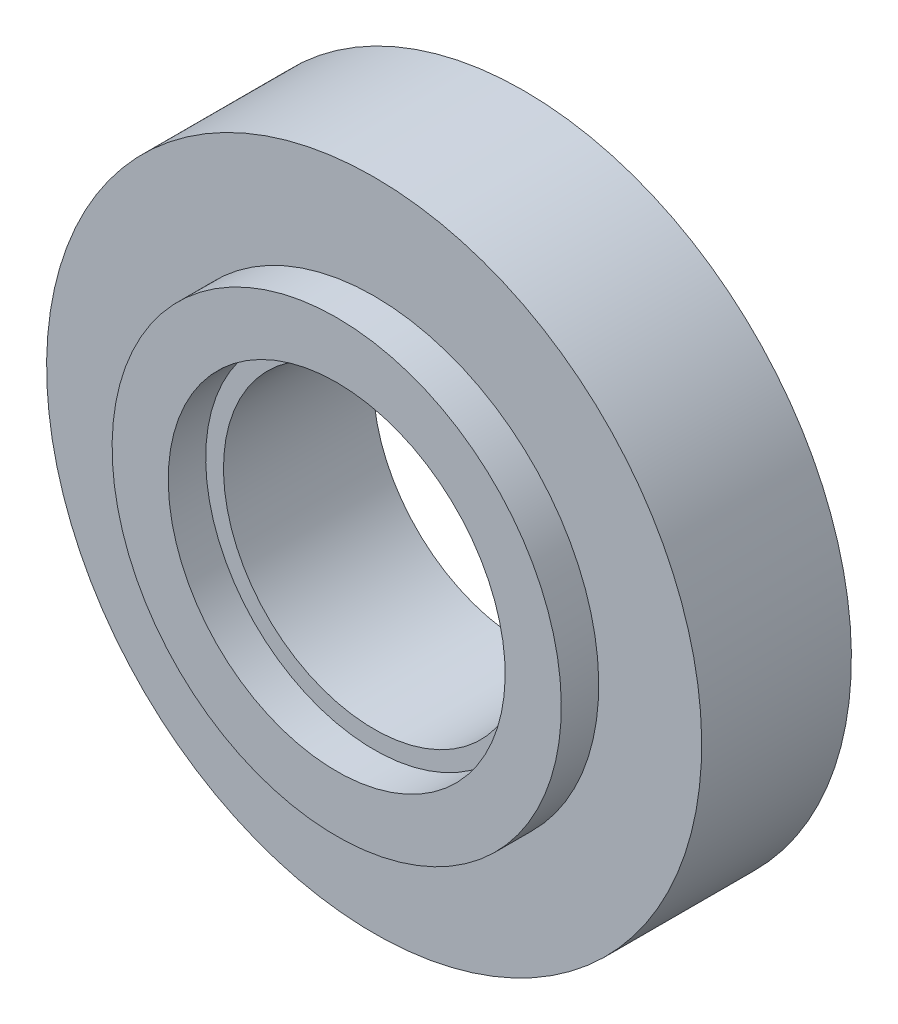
ISO-10303-21;
HEADER;
FILE_DESCRIPTION(('STEP AP214'),'2;1');
FILE_NAME('part.step','',(''),(''),'','','');
FILE_SCHEMA(('AUTOMOTIVE_DESIGN { 1 0 10303 214 1 1 1 1 }'));
ENDSEC;
DATA;
#1=APPLICATION_CONTEXT('core data for automotive mechanical design processes');
#2=APPLICATION_PROTOCOL_DEFINITION('international standard','automotive_design',2000,#1);
#3=PRODUCT_CONTEXT('',#1,'mechanical');
#4=PRODUCT('Part','Part','',(#3));
#5=PRODUCT_RELATED_PRODUCT_CATEGORY('part','',(#4));
#6=PRODUCT_DEFINITION_FORMATION('','',#4);
#7=PRODUCT_DEFINITION_CONTEXT('part definition',#1,'design');
#8=PRODUCT_DEFINITION('design','',#6,#7);
#9=PRODUCT_DEFINITION_SHAPE('','',#8);
#10=(LENGTH_UNIT() NAMED_UNIT(*) SI_UNIT(.MILLI.,.METRE.));
#11=(NAMED_UNIT(*) PLANE_ANGLE_UNIT() SI_UNIT($,.RADIAN.));
#12=(NAMED_UNIT(*) SI_UNIT($,.STERADIAN.) SOLID_ANGLE_UNIT());
#13=UNCERTAINTY_MEASURE_WITH_UNIT(LENGTH_MEASURE(1.E-05),#10,'distance_accuracy_value','');
#14=(GEOMETRIC_REPRESENTATION_CONTEXT(3) GLOBAL_UNCERTAINTY_ASSIGNED_CONTEXT((#13)) GLOBAL_UNIT_ASSIGNED_CONTEXT((#10,
#11,#12)) REPRESENTATION_CONTEXT('',''));
#15=CARTESIAN_POINT('',(0.,0.,0.));
#16=DIRECTION('',(0.,0.,1.));
#17=DIRECTION('',(1.,0.,0.));
#18=AXIS2_PLACEMENT_3D('',#15,#16,#17);
#19=CARTESIAN_POINT('',(0.,0.,16.));
#20=DIRECTION('',(0.,0.,-1.));
#21=DIRECTION('',(0.,1.,0.));
#22=AXIS2_PLACEMENT_3D('',#19,#20,#21);
#23=PLANE('',#22);
#24=CARTESIAN_POINT('',(0.,0.,16.));
#25=DIRECTION('',(0.,0.,-1.));
#26=DIRECTION('',(0.,1.,0.));
#27=AXIS2_PLACEMENT_3D('',#24,#25,#26);
#28=CIRCLE('',#27,12.);
#29=CARTESIAN_POINT('',(0.,12.,16.));
#30=VERTEX_POINT('',#29);
#31=EDGE_CURVE('E37',#30,#30,#28,.T.);
#32=ORIENTED_EDGE('',*,*,#31,.F.);
#33=EDGE_LOOP('',(#32));
#34=FACE_BOUND('',#33,.T.);
#35=CARTESIAN_POINT('',(0.,0.,16.));
#36=DIRECTION('',(0.,0.,-1.));
#37=DIRECTION('',(0.,1.,0.));
#38=AXIS2_PLACEMENT_3D('',#35,#36,#37);
#39=CIRCLE('',#38,8.99999999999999);
#40=CARTESIAN_POINT('',(0.,9.00000000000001,16.));
#41=VERTEX_POINT('',#40);
#42=EDGE_CURVE('E44',#41,#41,#39,.T.);
#43=ORIENTED_EDGE('',*,*,#42,.T.);
#44=EDGE_LOOP('',(#43));
#45=FACE_BOUND('',#44,.T.);
#46=ADVANCED_FACE('F33',(#34,#45),#23,.F.);
#47=CARTESIAN_POINT('',(0.,0.,14.));
#48=DIRECTION('',(0.,0.,1.));
#49=DIRECTION('',(0.,-1.,0.));
#50=AXIS2_PLACEMENT_3D('',#47,#48,#49);
#51=CYLINDRICAL_SURFACE('',#50,12.);
#52=CARTESIAN_POINT('',(0.,0.,14.));
#53=DIRECTION('',(0.,0.,-1.));
#54=DIRECTION('',(0.,1.,0.));
#55=AXIS2_PLACEMENT_3D('',#52,#53,#54);
#56=CIRCLE('',#55,12.);
#57=CARTESIAN_POINT('',(0.,12.,14.));
#58=VERTEX_POINT('',#57);
#59=EDGE_CURVE('E10',#58,#58,#56,.T.);
#60=ORIENTED_EDGE('',*,*,#59,.F.);
#61=EDGE_LOOP('',(#60));
#62=FACE_BOUND('',#61,.T.);
#63=ORIENTED_EDGE('',*,*,#31,.T.);
#64=EDGE_LOOP('',(#63));
#65=FACE_BOUND('',#64,.T.);
#66=ADVANCED_FACE('F35',(#62,#65),#51,.T.);
#67=CARTESIAN_POINT('',(0.,0.,14.));
#68=DIRECTION('',(0.,0.,1.));
#69=DIRECTION('',(0.,-1.,0.));
#70=AXIS2_PLACEMENT_3D('',#67,#68,#69);
#71=CYLINDRICAL_SURFACE('',#70,8.99999999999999);
#72=CARTESIAN_POINT('',(0.,0.,14.));
#73=DIRECTION('',(0.,0.,-1.));
#74=DIRECTION('',(0.,1.,0.));
#75=AXIS2_PLACEMENT_3D('',#72,#73,#74);
#76=CIRCLE('',#75,8.99999999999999);
#77=CARTESIAN_POINT('',(0.,9.00000000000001,14.));
#78=VERTEX_POINT('',#77);
#79=EDGE_CURVE('E48',#78,#78,#76,.T.);
#80=ORIENTED_EDGE('',*,*,#79,.T.);
#81=EDGE_LOOP('',(#80));
#82=FACE_BOUND('',#81,.T.);
#83=ORIENTED_EDGE('',*,*,#42,.F.);
#84=EDGE_LOOP('',(#83));
#85=FACE_BOUND('',#84,.T.);
#86=ADVANCED_FACE('F107',(#82,#85),#71,.F.);
#87=CARTESIAN_POINT('',(0.,0.,14.));
#88=DIRECTION('',(0.,0.,-1.));
#89=DIRECTION('',(0.,1.,0.));
#90=AXIS2_PLACEMENT_3D('',#87,#88,#89);
#91=PLANE('',#90);
#92=CARTESIAN_POINT('',(0.,0.,14.));
#93=DIRECTION('',(0.,0.,-1.));
#94=DIRECTION('',(0.,1.,0.));
#95=AXIS2_PLACEMENT_3D('',#92,#93,#94);
#96=CIRCLE('',#95,8.05);
#97=CARTESIAN_POINT('',(0.,8.05000000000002,14.));
#98=VERTEX_POINT('',#97);
#99=EDGE_CURVE('E58',#98,#98,#96,.T.);
#100=ORIENTED_EDGE('',*,*,#99,.T.);
#101=EDGE_LOOP('',(#100));
#102=FACE_BOUND('',#101,.T.);
#103=ORIENTED_EDGE('',*,*,#79,.F.);
#104=EDGE_LOOP('',(#103));
#105=FACE_BOUND('',#104,.T.);
#106=ADVANCED_FACE('F89',(#102,#105),#91,.F.);
#107=CARTESIAN_POINT('',(0.,0.,6.00000000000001));
#108=DIRECTION('',(0.,0.,-1.));
#109=DIRECTION('',(0.,1.,0.));
#110=AXIS2_PLACEMENT_3D('',#107,#108,#109);
#111=PLANE('',#110);
#112=CARTESIAN_POINT('',(0.,-13.,6.));
#113=DIRECTION('',(0.,0.,-1.));
#114=DIRECTION('',(0.,1.,0.));
#115=AXIS2_PLACEMENT_3D('',#112,#113,#114);
#116=CIRCLE('',#115,1.6);
#117=CARTESIAN_POINT('',(0.,-11.4,6.));
#118=VERTEX_POINT('',#117);
#119=EDGE_CURVE('E70',#118,#118,#116,.T.);
#120=ORIENTED_EDGE('',*,*,#119,.F.);
#121=EDGE_LOOP('',(#120));
#122=FACE_BOUND('',#121,.T.);
#123=CARTESIAN_POINT('',(0.,13.,6.00000000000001));
#124=DIRECTION('',(0.,0.,-1.));
#125=DIRECTION('',(0.,1.,0.));
#126=AXIS2_PLACEMENT_3D('',#123,#124,#125);
#127=CIRCLE('',#126,1.6);
#128=CARTESIAN_POINT('',(0.,14.6,6.00000000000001));
#129=VERTEX_POINT('',#128);
#130=EDGE_CURVE('E64',#129,#129,#127,.T.);
#131=ORIENTED_EDGE('',*,*,#130,.F.);
#132=EDGE_LOOP('',(#131));
#133=FACE_BOUND('',#132,.T.);
#134=CARTESIAN_POINT('',(0.,0.,6.00000000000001));
#135=DIRECTION('',(0.,0.,-1.));
#136=DIRECTION('',(0.,1.,0.));
#137=AXIS2_PLACEMENT_3D('',#134,#135,#136);
#138=CIRCLE('',#137,17.5);
#139=CARTESIAN_POINT('',(0.,17.5,6.00000000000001));
#140=VERTEX_POINT('',#139);
#141=EDGE_CURVE('E51',#140,#140,#138,.T.);
#142=ORIENTED_EDGE('',*,*,#141,.T.);
#143=EDGE_LOOP('',(#142));
#144=FACE_BOUND('',#143,.T.);
#145=CARTESIAN_POINT('',(0.,0.,6.00000000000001));
#146=DIRECTION('',(0.,0.,-1.));
#147=DIRECTION('',(0.,1.,0.));
#148=AXIS2_PLACEMENT_3D('',#145,#146,#147);
#149=CIRCLE('',#148,8.05);
#150=CARTESIAN_POINT('',(0.,8.05000000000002,6.00000000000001));
#151=VERTEX_POINT('',#150);
#152=EDGE_CURVE('E55',#151,#151,#149,.T.);
#153=ORIENTED_EDGE('',*,*,#152,.F.);
#154=EDGE_LOOP('',(#153));
#155=FACE_BOUND('',#154,.T.);
#156=ADVANCED_FACE('F85',(#122,#133,#144,#155),#111,.T.);
#157=ORIENTED_EDGE('',*,*,#59,.T.);
#158=EDGE_LOOP('',(#157));
#159=FACE_BOUND('',#158,.T.);
#160=CARTESIAN_POINT('',(0.,0.,14.));
#161=DIRECTION('',(0.,0.,-1.));
#162=DIRECTION('',(0.,1.,0.));
#163=AXIS2_PLACEMENT_3D('',#160,#161,#162);
#164=CIRCLE('',#163,17.5);
#165=CARTESIAN_POINT('',(0.,17.5,14.));
#166=VERTEX_POINT('',#165);
#167=EDGE_CURVE('E52',#166,#166,#164,.T.);
#168=ORIENTED_EDGE('',*,*,#167,.F.);
#169=EDGE_LOOP('',(#168));
#170=FACE_BOUND('',#169,.T.);
#171=ADVANCED_FACE('F88',(#159,#170),#91,.F.);
#172=CARTESIAN_POINT('',(0.,0.,6.00000000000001));
#173=DIRECTION('',(0.,0.,1.));
#174=DIRECTION('',(0.,-1.,0.));
#175=AXIS2_PLACEMENT_3D('',#172,#173,#174);
#176=CYLINDRICAL_SURFACE('',#175,17.5);
#177=ORIENTED_EDGE('',*,*,#141,.F.);
#178=EDGE_LOOP('',(#177));
#179=FACE_BOUND('',#178,.T.);
#180=ORIENTED_EDGE('',*,*,#167,.T.);
#181=EDGE_LOOP('',(#180));
#182=FACE_BOUND('',#181,.T.);
#183=ADVANCED_FACE('F101',(#179,#182),#176,.T.);
#184=CARTESIAN_POINT('',(0.,0.,6.00000000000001));
#185=DIRECTION('',(0.,0.,1.));
#186=DIRECTION('',(0.,-1.,0.));
#187=AXIS2_PLACEMENT_3D('',#184,#185,#186);
#188=CYLINDRICAL_SURFACE('',#187,8.05);
#189=ORIENTED_EDGE('',*,*,#152,.T.);
#190=EDGE_LOOP('',(#189));
#191=FACE_BOUND('',#190,.T.);
#192=ORIENTED_EDGE('',*,*,#99,.F.);
#193=EDGE_LOOP('',(#192));
#194=FACE_BOUND('',#193,.T.);
#195=ADVANCED_FACE('F97',(#191,#194),#188,.F.);
#196=CARTESIAN_POINT('',(0.,13.,11.));
#197=DIRECTION('',(0.,0.,-1.));
#198=DIRECTION('',(0.,1.,0.));
#199=AXIS2_PLACEMENT_3D('',#196,#197,#198);
#200=CYLINDRICAL_SURFACE('',#199,1.6);
#201=CARTESIAN_POINT('',(0.,13.,11.));
#202=DIRECTION('',(0.,0.,-1.));
#203=DIRECTION('',(0.,1.,0.));
#204=AXIS2_PLACEMENT_3D('',#201,#202,#203);
#205=CIRCLE('',#204,1.6);
#206=CARTESIAN_POINT('',(0.,14.6,11.));
#207=VERTEX_POINT('',#206);
#208=EDGE_CURVE('E67',#207,#207,#205,.T.);
#209=ORIENTED_EDGE('',*,*,#208,.F.);
#210=EDGE_LOOP('',(#209));
#211=FACE_BOUND('',#210,.T.);
#212=ORIENTED_EDGE('',*,*,#130,.T.);
#213=EDGE_LOOP('',(#212));
#214=FACE_BOUND('',#213,.T.);
#215=ADVANCED_FACE('F100',(#211,#214),#200,.F.);
#216=CARTESIAN_POINT('',(0.,13.,11.));
#217=DIRECTION('',(0.,0.,-1.));
#218=DIRECTION('',(0.,1.,0.));
#219=AXIS2_PLACEMENT_3D('',#216,#217,#218);
#220=PLANE('',#219);
#221=ORIENTED_EDGE('',*,*,#208,.T.);
#222=EDGE_LOOP('',(#221));
#223=FACE_BOUND('',#222,.T.);
#224=ADVANCED_FACE('F81',(#223),#220,.T.);
#225=CARTESIAN_POINT('',(0.,-13.,11.));
#226=DIRECTION('',(0.,0.,-1.));
#227=DIRECTION('',(0.,1.,0.));
#228=AXIS2_PLACEMENT_3D('',#225,#226,#227);
#229=CYLINDRICAL_SURFACE('',#228,1.6);
#230=CARTESIAN_POINT('',(0.,-13.,11.));
#231=DIRECTION('',(0.,0.,-1.));
#232=DIRECTION('',(0.,1.,0.));
#233=AXIS2_PLACEMENT_3D('',#230,#231,#232);
#234=CIRCLE('',#233,1.6);
#235=CARTESIAN_POINT('',(0.,-11.4,11.));
#236=VERTEX_POINT('',#235);
#237=EDGE_CURVE('E61',#236,#236,#234,.T.);
#238=ORIENTED_EDGE('',*,*,#237,.F.);
#239=EDGE_LOOP('',(#238));
#240=FACE_BOUND('',#239,.T.);
#241=ORIENTED_EDGE('',*,*,#119,.T.);
#242=EDGE_LOOP('',(#241));
#243=FACE_BOUND('',#242,.T.);
#244=ADVANCED_FACE('F78',(#240,#243),#229,.F.);
#245=CARTESIAN_POINT('',(0.,-13.,11.));
#246=DIRECTION('',(0.,0.,-1.));
#247=DIRECTION('',(0.,1.,0.));
#248=AXIS2_PLACEMENT_3D('',#245,#246,#247);
#249=PLANE('',#248);
#250=ORIENTED_EDGE('',*,*,#237,.T.);
#251=EDGE_LOOP('',(#250));
#252=FACE_BOUND('',#251,.T.);
#253=ADVANCED_FACE('F76',(#252),#249,.T.);
#254=CLOSED_SHELL('',(#46,#66,#86,#106,#156,#171,#183,#195,#215,#224,#244,#253));
#255=MANIFOLD_SOLID_BREP('B2',#254);
#256=ADVANCED_BREP_SHAPE_REPRESENTATION('',(#18,#255),#14);
#257=SHAPE_DEFINITION_REPRESENTATION(#9,#256);
ENDSEC;
END-ISO-10303-21;
